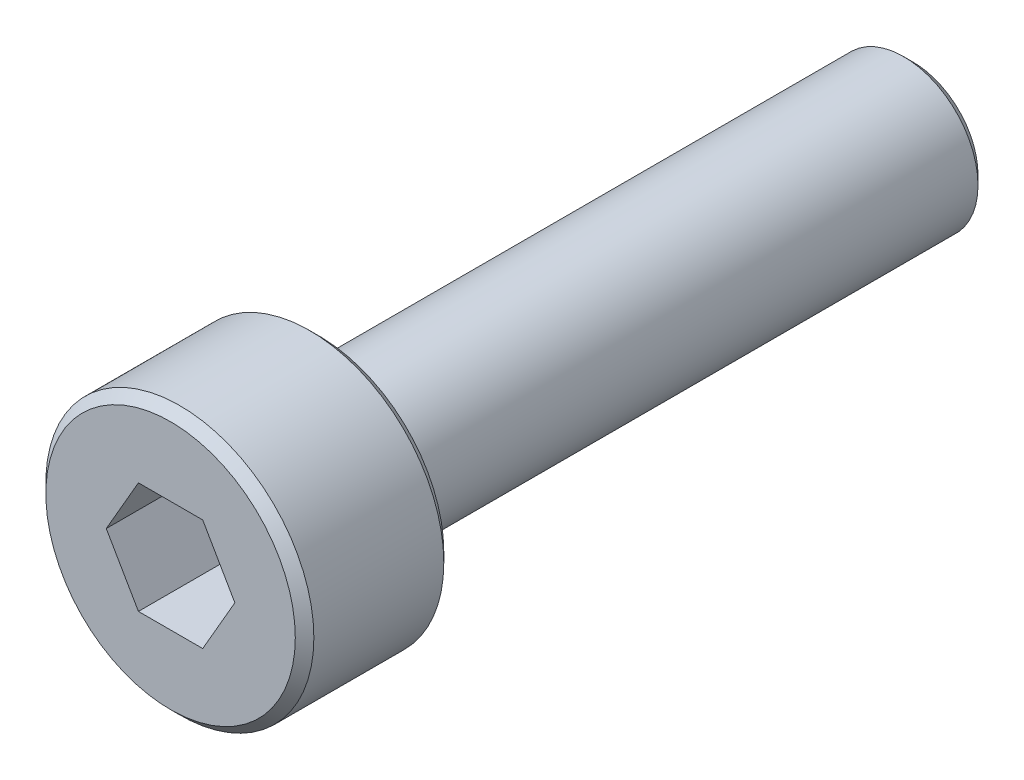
ISO-10303-21;
HEADER;
FILE_DESCRIPTION(('STEP AP214'),'2;1');
FILE_NAME('part.step','',(''),(''),'','','');
FILE_SCHEMA(('AUTOMOTIVE_DESIGN { 1 0 10303 214 1 1 1 1 }'));
ENDSEC;
DATA;
#1=APPLICATION_CONTEXT('core data for automotive mechanical design processes');
#2=APPLICATION_PROTOCOL_DEFINITION('international standard','automotive_design',2000,#1);
#3=PRODUCT_CONTEXT('',#1,'mechanical');
#4=PRODUCT('Part','Part','',(#3));
#5=PRODUCT_RELATED_PRODUCT_CATEGORY('part','',(#4));
#6=PRODUCT_DEFINITION_FORMATION('','',#4);
#7=PRODUCT_DEFINITION_CONTEXT('part definition',#1,'design');
#8=PRODUCT_DEFINITION('design','',#6,#7);
#9=PRODUCT_DEFINITION_SHAPE('','',#8);
#10=(LENGTH_UNIT() NAMED_UNIT(*) SI_UNIT(.MILLI.,.METRE.));
#11=(NAMED_UNIT(*) PLANE_ANGLE_UNIT() SI_UNIT($,.RADIAN.));
#12=(NAMED_UNIT(*) SI_UNIT($,.STERADIAN.) SOLID_ANGLE_UNIT());
#13=UNCERTAINTY_MEASURE_WITH_UNIT(LENGTH_MEASURE(1.E-05),#10,'distance_accuracy_value','');
#14=(GEOMETRIC_REPRESENTATION_CONTEXT(3) GLOBAL_UNCERTAINTY_ASSIGNED_CONTEXT((#13)) GLOBAL_UNIT_ASSIGNED_CONTEXT((#10,
#11,#12)) REPRESENTATION_CONTEXT('',''));
#15=CARTESIAN_POINT('',(0.,0.,0.));
#16=DIRECTION('',(0.,0.,1.));
#17=DIRECTION('',(1.,0.,0.));
#18=AXIS2_PLACEMENT_3D('',#15,#16,#17);
#19=CARTESIAN_POINT('',(0.,0.,16.));
#20=DIRECTION('',(0.,0.,-1.));
#21=DIRECTION('',(-1.,0.,0.));
#22=AXIS2_PLACEMENT_3D('',#19,#20,#21);
#23=CYLINDRICAL_SURFACE('',#22,2.);
#24=CARTESIAN_POINT('',(0.,0.,0.250000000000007));
#25=DIRECTION('',(0.,0.,1.));
#26=DIRECTION('',(1.,0.,0.));
#27=AXIS2_PLACEMENT_3D('',#24,#25,#26);
#28=CIRCLE('',#27,2.);
#29=CARTESIAN_POINT('',(2.,0.,0.250000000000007));
#30=VERTEX_POINT('',#29);
#31=EDGE_CURVE('E176',#30,#30,#28,.T.);
#32=ORIENTED_EDGE('',*,*,#31,.T.);
#33=EDGE_LOOP('',(#32));
#34=FACE_BOUND('',#33,.T.);
#35=CARTESIAN_POINT('',(0.,0.,16.));
#36=DIRECTION('',(0.,0.,1.));
#37=DIRECTION('',(1.,0.,0.));
#38=AXIS2_PLACEMENT_3D('',#35,#36,#37);
#39=CIRCLE('',#38,2.);
#40=CARTESIAN_POINT('',(2.,0.,16.));
#41=VERTEX_POINT('',#40);
#42=EDGE_CURVE('E162',#41,#41,#39,.T.);
#43=ORIENTED_EDGE('',*,*,#42,.F.);
#44=EDGE_LOOP('',(#43));
#45=FACE_BOUND('',#44,.T.);
#46=ADVANCED_FACE('F50',(#34,#45),#23,.T.);
#47=CARTESIAN_POINT('',(0.,0.,0.));
#48=DIRECTION('',(0.,0.,1.));
#49=DIRECTION('',(1.,0.,0.));
#50=AXIS2_PLACEMENT_3D('',#47,#48,#49);
#51=PLANE('',#50);
#52=CARTESIAN_POINT('',(0.,0.,0.));
#53=DIRECTION('',(0.,0.,1.));
#54=DIRECTION('',(1.,0.,0.));
#55=AXIS2_PLACEMENT_3D('',#52,#53,#54);
#56=CIRCLE('',#55,1.74999999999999);
#57=CARTESIAN_POINT('',(1.74999999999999,0.,0.));
#58=VERTEX_POINT('',#57);
#59=EDGE_CURVE('E179',#58,#58,#56,.F.);
#60=ORIENTED_EDGE('',*,*,#59,.T.);
#61=EDGE_LOOP('',(#60));
#62=FACE_BOUND('',#61,.T.);
#63=ADVANCED_FACE('F208',(#62),#51,.F.);
#64=CARTESIAN_POINT('',(0.,0.,20.));
#65=DIRECTION('',(0.,0.,-1.));
#66=DIRECTION('',(-1.,0.,0.));
#67=AXIS2_PLACEMENT_3D('',#64,#65,#66);
#68=CYLINDRICAL_SURFACE('',#67,3.61);
#69=CARTESIAN_POINT('',(0.,0.,16.25));
#70=DIRECTION('',(0.,0.,1.));
#71=DIRECTION('',(1.,0.,0.));
#72=AXIS2_PLACEMENT_3D('',#69,#70,#71);
#73=CIRCLE('',#72,3.61);
#74=CARTESIAN_POINT('',(3.61,0.,16.25));
#75=VERTEX_POINT('',#74);
#76=EDGE_CURVE('E190',#75,#75,#73,.T.);
#77=ORIENTED_EDGE('',*,*,#76,.T.);
#78=EDGE_LOOP('',(#77));
#79=FACE_BOUND('',#78,.T.);
#80=CARTESIAN_POINT('',(0.,0.,19.75));
#81=DIRECTION('',(0.,0.,1.));
#82=DIRECTION('',(1.,0.,0.));
#83=AXIS2_PLACEMENT_3D('',#80,#81,#82);
#84=CIRCLE('',#83,3.61);
#85=CARTESIAN_POINT('',(3.61,0.,19.75));
#86=VERTEX_POINT('',#85);
#87=EDGE_CURVE('E184',#86,#86,#84,.F.);
#88=ORIENTED_EDGE('',*,*,#87,.T.);
#89=EDGE_LOOP('',(#88));
#90=FACE_BOUND('',#89,.T.);
#91=ADVANCED_FACE('F204',(#79,#90),#68,.T.);
#92=CARTESIAN_POINT('',(0.,0.,20.));
#93=DIRECTION('',(0.,0.,1.));
#94=DIRECTION('',(1.,0.,0.));
#95=AXIS2_PLACEMENT_3D('',#92,#93,#94);
#96=PLANE('',#95);
#97=CARTESIAN_POINT('',(0.,0.,20.));
#98=DIRECTION('',(0.,0.,1.));
#99=DIRECTION('',(1.,0.,0.));
#100=AXIS2_PLACEMENT_3D('',#97,#98,#99);
#101=CIRCLE('',#100,3.36);
#102=CARTESIAN_POINT('',(3.36,0.,20.));
#103=VERTEX_POINT('',#102);
#104=EDGE_CURVE('E11',#103,#103,#101,.T.);
#105=ORIENTED_EDGE('',*,*,#104,.T.);
#106=EDGE_LOOP('',(#105));
#107=FACE_BOUND('',#106,.T.);
#108=DIRECTION('',(0.5,0.866025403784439,0.));
#109=VECTOR('',#108,1.);
#110=CARTESIAN_POINT('',(0.866025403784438,-1.5,20.));
#111=LINE('',#110,#109);
#112=CARTESIAN_POINT('',(0.866025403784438,-1.5,20.));
#113=VERTEX_POINT('',#112);
#114=CARTESIAN_POINT('',(1.73205080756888,0.,20.));
#115=VERTEX_POINT('',#114);
#116=EDGE_CURVE('E61',#113,#115,#111,.T.);
#117=ORIENTED_EDGE('',*,*,#116,.F.);
#118=DIRECTION('',(1.,0.,0.));
#119=VECTOR('',#118,1.);
#120=CARTESIAN_POINT('',(-0.866025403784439,-1.5,20.));
#121=LINE('',#120,#119);
#122=CARTESIAN_POINT('',(-0.866025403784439,-1.5,20.));
#123=VERTEX_POINT('',#122);
#124=EDGE_CURVE('E160',#123,#113,#121,.T.);
#125=ORIENTED_EDGE('',*,*,#124,.F.);
#126=DIRECTION('',(0.5,-0.866025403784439,0.));
#127=VECTOR('',#126,1.);
#128=CARTESIAN_POINT('',(-1.73205080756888,0.,20.));
#129=LINE('',#128,#127);
#130=CARTESIAN_POINT('',(-1.73205080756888,0.,20.));
#131=VERTEX_POINT('',#130);
#132=EDGE_CURVE('E152',#131,#123,#129,.T.);
#133=ORIENTED_EDGE('',*,*,#132,.F.);
#134=DIRECTION('',(-0.5,-0.866025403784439,0.));
#135=VECTOR('',#134,1.);
#136=CARTESIAN_POINT('',(-0.866025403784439,1.5,20.));
#137=LINE('',#136,#135);
#138=CARTESIAN_POINT('',(-0.866025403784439,1.5,20.));
#139=VERTEX_POINT('',#138);
#140=EDGE_CURVE('E115',#139,#131,#137,.T.);
#141=ORIENTED_EDGE('',*,*,#140,.F.);
#142=DIRECTION('',(-1.,0.,0.));
#143=VECTOR('',#142,1.);
#144=CARTESIAN_POINT('',(0.866025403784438,1.5,20.));
#145=LINE('',#144,#143);
#146=CARTESIAN_POINT('',(0.866025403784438,1.5,20.));
#147=VERTEX_POINT('',#146);
#148=EDGE_CURVE('E146',#147,#139,#145,.T.);
#149=ORIENTED_EDGE('',*,*,#148,.F.);
#150=DIRECTION('',(-0.5,0.866025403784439,0.));
#151=VECTOR('',#150,1.);
#152=CARTESIAN_POINT('',(1.73205080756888,0.,20.));
#153=LINE('',#152,#151);
#154=EDGE_CURVE('E145',#115,#147,#153,.T.);
#155=ORIENTED_EDGE('',*,*,#154,.F.);
#156=EDGE_LOOP('',(#117,#125,#133,#141,#149,#155));
#157=FACE_BOUND('',#156,.T.);
#158=ADVANCED_FACE('F210',(#107,#157),#96,.T.);
#159=CARTESIAN_POINT('',(0.,0.,16.));
#160=DIRECTION('',(0.,0.,1.));
#161=DIRECTION('',(1.,0.,0.));
#162=AXIS2_PLACEMENT_3D('',#159,#160,#161);
#163=PLANE('',#162);
#164=CARTESIAN_POINT('',(0.,0.,16.));
#165=DIRECTION('',(0.,0.,1.));
#166=DIRECTION('',(1.,0.,0.));
#167=AXIS2_PLACEMENT_3D('',#164,#165,#166);
#168=CIRCLE('',#167,3.36);
#169=CARTESIAN_POINT('',(3.36,0.,16.));
#170=VERTEX_POINT('',#169);
#171=EDGE_CURVE('E60',#170,#170,#168,.F.);
#172=ORIENTED_EDGE('',*,*,#171,.T.);
#173=EDGE_LOOP('',(#172));
#174=FACE_BOUND('',#173,.T.);
#175=ORIENTED_EDGE('',*,*,#42,.T.);
#176=EDGE_LOOP('',(#175));
#177=FACE_BOUND('',#176,.T.);
#178=ADVANCED_FACE('F194',(#174,#177),#163,.F.);
#179=CARTESIAN_POINT('',(0.866025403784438,-1.5,17.5));
#180=DIRECTION('',(0.866025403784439,-0.5,0.));
#181=DIRECTION('',(0.5,0.866025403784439,0.));
#182=AXIS2_PLACEMENT_3D('',#179,#180,#181);
#183=PLANE('',#182);
#184=ORIENTED_EDGE('',*,*,#116,.T.);
#185=DIRECTION('',(0.,0.,1.));
#186=VECTOR('',#185,1.);
#187=CARTESIAN_POINT('',(1.73205080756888,0.,17.5));
#188=LINE('',#187,#186);
#189=CARTESIAN_POINT('',(1.73205080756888,0.,17.5));
#190=VERTEX_POINT('',#189);
#191=EDGE_CURVE('E94',#190,#115,#188,.T.);
#192=ORIENTED_EDGE('',*,*,#191,.F.);
#193=DIRECTION('',(0.5,0.866025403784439,0.));
#194=VECTOR('',#193,1.);
#195=CARTESIAN_POINT('',(0.866025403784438,-1.5,17.5));
#196=LINE('',#195,#194);
#197=CARTESIAN_POINT('',(0.866025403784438,-1.5,17.5));
#198=VERTEX_POINT('',#197);
#199=EDGE_CURVE('E159',#198,#190,#196,.T.);
#200=ORIENTED_EDGE('',*,*,#199,.F.);
#201=DIRECTION('',(0.,0.,1.));
#202=VECTOR('',#201,1.);
#203=CARTESIAN_POINT('',(0.866025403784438,-1.5,17.5));
#204=LINE('',#203,#202);
#205=EDGE_CURVE('E75',#198,#113,#204,.T.);
#206=ORIENTED_EDGE('',*,*,#205,.T.);
#207=EDGE_LOOP('',(#184,#192,#200,#206));
#208=FACE_BOUND('',#207,.T.);
#209=ADVANCED_FACE('F229',(#208),#183,.F.);
#210=CARTESIAN_POINT('',(-0.866025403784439,-1.5,17.5));
#211=DIRECTION('',(0.,-1.,0.));
#212=DIRECTION('',(1.,0.,0.));
#213=AXIS2_PLACEMENT_3D('',#210,#211,#212);
#214=PLANE('',#213);
#215=ORIENTED_EDGE('',*,*,#124,.T.);
#216=ORIENTED_EDGE('',*,*,#205,.F.);
#217=DIRECTION('',(1.,0.,0.));
#218=VECTOR('',#217,1.);
#219=CARTESIAN_POINT('',(-0.866025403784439,-1.5,17.5));
#220=LINE('',#219,#218);
#221=CARTESIAN_POINT('',(-0.866025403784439,-1.5,17.5));
#222=VERTEX_POINT('',#221);
#223=EDGE_CURVE('E127',#222,#198,#220,.T.);
#224=ORIENTED_EDGE('',*,*,#223,.F.);
#225=DIRECTION('',(0.,0.,1.));
#226=VECTOR('',#225,1.);
#227=CARTESIAN_POINT('',(-0.866025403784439,-1.5,17.5));
#228=LINE('',#227,#226);
#229=EDGE_CURVE('E119',#222,#123,#228,.T.);
#230=ORIENTED_EDGE('',*,*,#229,.T.);
#231=EDGE_LOOP('',(#215,#216,#224,#230));
#232=FACE_BOUND('',#231,.T.);
#233=ADVANCED_FACE('F226',(#232),#214,.F.);
#234=CARTESIAN_POINT('',(-1.73205080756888,0.,17.5));
#235=DIRECTION('',(-0.866025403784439,-0.5,0.));
#236=DIRECTION('',(0.5,-0.866025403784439,0.));
#237=AXIS2_PLACEMENT_3D('',#234,#235,#236);
#238=PLANE('',#237);
#239=ORIENTED_EDGE('',*,*,#132,.T.);
#240=ORIENTED_EDGE('',*,*,#229,.F.);
#241=DIRECTION('',(0.5,-0.866025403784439,0.));
#242=VECTOR('',#241,1.);
#243=CARTESIAN_POINT('',(-1.73205080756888,0.,17.5));
#244=LINE('',#243,#242);
#245=CARTESIAN_POINT('',(-1.73205080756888,0.,17.5));
#246=VERTEX_POINT('',#245);
#247=EDGE_CURVE('E121',#246,#222,#244,.T.);
#248=ORIENTED_EDGE('',*,*,#247,.F.);
#249=DIRECTION('',(0.,0.,1.));
#250=VECTOR('',#249,1.);
#251=CARTESIAN_POINT('',(-1.73205080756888,0.,17.5));
#252=LINE('',#251,#250);
#253=EDGE_CURVE('E104',#246,#131,#252,.T.);
#254=ORIENTED_EDGE('',*,*,#253,.T.);
#255=EDGE_LOOP('',(#239,#240,#248,#254));
#256=FACE_BOUND('',#255,.T.);
#257=ADVANCED_FACE('F125',(#256),#238,.F.);
#258=CARTESIAN_POINT('',(-0.866025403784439,1.5,17.5));
#259=DIRECTION('',(-0.866025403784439,0.5,0.));
#260=DIRECTION('',(-0.5,-0.866025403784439,0.));
#261=AXIS2_PLACEMENT_3D('',#258,#259,#260);
#262=PLANE('',#261);
#263=ORIENTED_EDGE('',*,*,#140,.T.);
#264=ORIENTED_EDGE('',*,*,#253,.F.);
#265=DIRECTION('',(-0.5,-0.866025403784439,0.));
#266=VECTOR('',#265,1.);
#267=CARTESIAN_POINT('',(-0.866025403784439,1.5,17.5));
#268=LINE('',#267,#266);
#269=CARTESIAN_POINT('',(-0.866025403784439,1.5,17.5));
#270=VERTEX_POINT('',#269);
#271=EDGE_CURVE('E108',#270,#246,#268,.T.);
#272=ORIENTED_EDGE('',*,*,#271,.F.);
#273=DIRECTION('',(0.,0.,1.));
#274=VECTOR('',#273,1.);
#275=CARTESIAN_POINT('',(-0.866025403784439,1.5,17.5));
#276=LINE('',#275,#274);
#277=EDGE_CURVE('E120',#270,#139,#276,.T.);
#278=ORIENTED_EDGE('',*,*,#277,.T.);
#279=EDGE_LOOP('',(#263,#264,#272,#278));
#280=FACE_BOUND('',#279,.T.);
#281=ADVANCED_FACE('F110',(#280),#262,.F.);
#282=CARTESIAN_POINT('',(0.866025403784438,1.5,17.5));
#283=DIRECTION('',(0.,1.,0.));
#284=DIRECTION('',(-1.,0.,0.));
#285=AXIS2_PLACEMENT_3D('',#282,#283,#284);
#286=PLANE('',#285);
#287=ORIENTED_EDGE('',*,*,#148,.T.);
#288=ORIENTED_EDGE('',*,*,#277,.F.);
#289=DIRECTION('',(-1.,0.,0.));
#290=VECTOR('',#289,1.);
#291=CARTESIAN_POINT('',(0.866025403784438,1.5,17.5));
#292=LINE('',#291,#290);
#293=CARTESIAN_POINT('',(0.866025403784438,1.5,17.5));
#294=VERTEX_POINT('',#293);
#295=EDGE_CURVE('E134',#294,#270,#292,.T.);
#296=ORIENTED_EDGE('',*,*,#295,.F.);
#297=DIRECTION('',(0.,0.,1.));
#298=VECTOR('',#297,1.);
#299=CARTESIAN_POINT('',(0.866025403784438,1.5,17.5));
#300=LINE('',#299,#298);
#301=EDGE_CURVE('E169',#294,#147,#300,.T.);
#302=ORIENTED_EDGE('',*,*,#301,.T.);
#303=EDGE_LOOP('',(#287,#288,#296,#302));
#304=FACE_BOUND('',#303,.T.);
#305=ADVANCED_FACE('F268',(#304),#286,.F.);
#306=CARTESIAN_POINT('',(1.73205080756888,0.,17.5));
#307=DIRECTION('',(0.866025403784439,0.5,0.));
#308=DIRECTION('',(-0.5,0.866025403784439,0.));
#309=AXIS2_PLACEMENT_3D('',#306,#307,#308);
#310=PLANE('',#309);
#311=ORIENTED_EDGE('',*,*,#154,.T.);
#312=ORIENTED_EDGE('',*,*,#301,.F.);
#313=DIRECTION('',(-0.5,0.866025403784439,0.));
#314=VECTOR('',#313,1.);
#315=CARTESIAN_POINT('',(1.73205080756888,0.,17.5));
#316=LINE('',#315,#314);
#317=EDGE_CURVE('E136',#190,#294,#316,.T.);
#318=ORIENTED_EDGE('',*,*,#317,.F.);
#319=ORIENTED_EDGE('',*,*,#191,.T.);
#320=EDGE_LOOP('',(#311,#312,#318,#319));
#321=FACE_BOUND('',#320,.T.);
#322=ADVANCED_FACE('F224',(#321),#310,.F.);
#323=CARTESIAN_POINT('',(0.,0.,17.5));
#324=DIRECTION('',(0.,0.,1.));
#325=DIRECTION('',(1.,0.,0.));
#326=AXIS2_PLACEMENT_3D('',#323,#324,#325);
#327=PLANE('',#326);
#328=ORIENTED_EDGE('',*,*,#199,.T.);
#329=ORIENTED_EDGE('',*,*,#317,.T.);
#330=ORIENTED_EDGE('',*,*,#295,.T.);
#331=ORIENTED_EDGE('',*,*,#271,.T.);
#332=ORIENTED_EDGE('',*,*,#247,.T.);
#333=ORIENTED_EDGE('',*,*,#223,.T.);
#334=EDGE_LOOP('',(#328,#329,#330,#331,#332,#333));
#335=FACE_BOUND('',#334,.T.);
#336=ADVANCED_FACE('F129',(#335),#327,.T.);
#337=CARTESIAN_POINT('',(0.,0.,0.250000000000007));
#338=DIRECTION('',(0.,0.,1.));
#339=DIRECTION('',(1.,0.,0.));
#340=AXIS2_PLACEMENT_3D('',#337,#338,#339);
#341=CONICAL_SURFACE('',#340,2.,0.785398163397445);
#342=ORIENTED_EDGE('',*,*,#59,.F.);
#343=EDGE_LOOP('',(#342));
#344=FACE_BOUND('',#343,.T.);
#345=ORIENTED_EDGE('',*,*,#31,.F.);
#346=EDGE_LOOP('',(#345));
#347=FACE_BOUND('',#346,.T.);
#348=ADVANCED_FACE('F203',(#344,#347),#341,.T.);
#349=CARTESIAN_POINT('',(0.,0.,16.25));
#350=DIRECTION('',(0.,0.,1.));
#351=DIRECTION('',(1.,0.,0.));
#352=AXIS2_PLACEMENT_3D('',#349,#350,#351);
#353=CONICAL_SURFACE('',#352,3.61,0.785398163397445);
#354=ORIENTED_EDGE('',*,*,#171,.F.);
#355=EDGE_LOOP('',(#354));
#356=FACE_BOUND('',#355,.T.);
#357=ORIENTED_EDGE('',*,*,#76,.F.);
#358=EDGE_LOOP('',(#357));
#359=FACE_BOUND('',#358,.T.);
#360=ADVANCED_FACE('F196',(#356,#359),#353,.T.);
#361=CARTESIAN_POINT('',(0.,0.,20.));
#362=DIRECTION('',(0.,0.,-1.));
#363=DIRECTION('',(-1.,0.,0.));
#364=AXIS2_PLACEMENT_3D('',#361,#362,#363);
#365=CONICAL_SURFACE('',#364,3.36,0.785398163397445);
#366=ORIENTED_EDGE('',*,*,#87,.F.);
#367=EDGE_LOOP('',(#366));
#368=FACE_BOUND('',#367,.T.);
#369=ORIENTED_EDGE('',*,*,#104,.F.);
#370=EDGE_LOOP('',(#369));
#371=FACE_BOUND('',#370,.T.);
#372=ADVANCED_FACE('F49',(#368,#371),#365,.T.);
#373=CLOSED_SHELL('',(#46,#63,#91,#158,#178,#209,#233,#257,#281,#305,#322,#336,#348,#360,#372));
#374=MANIFOLD_SOLID_BREP('B2',#373);
#375=ADVANCED_BREP_SHAPE_REPRESENTATION('',(#18,#374),#14);
#376=SHAPE_DEFINITION_REPRESENTATION(#9,#375);
ENDSEC;
END-ISO-10303-21;
